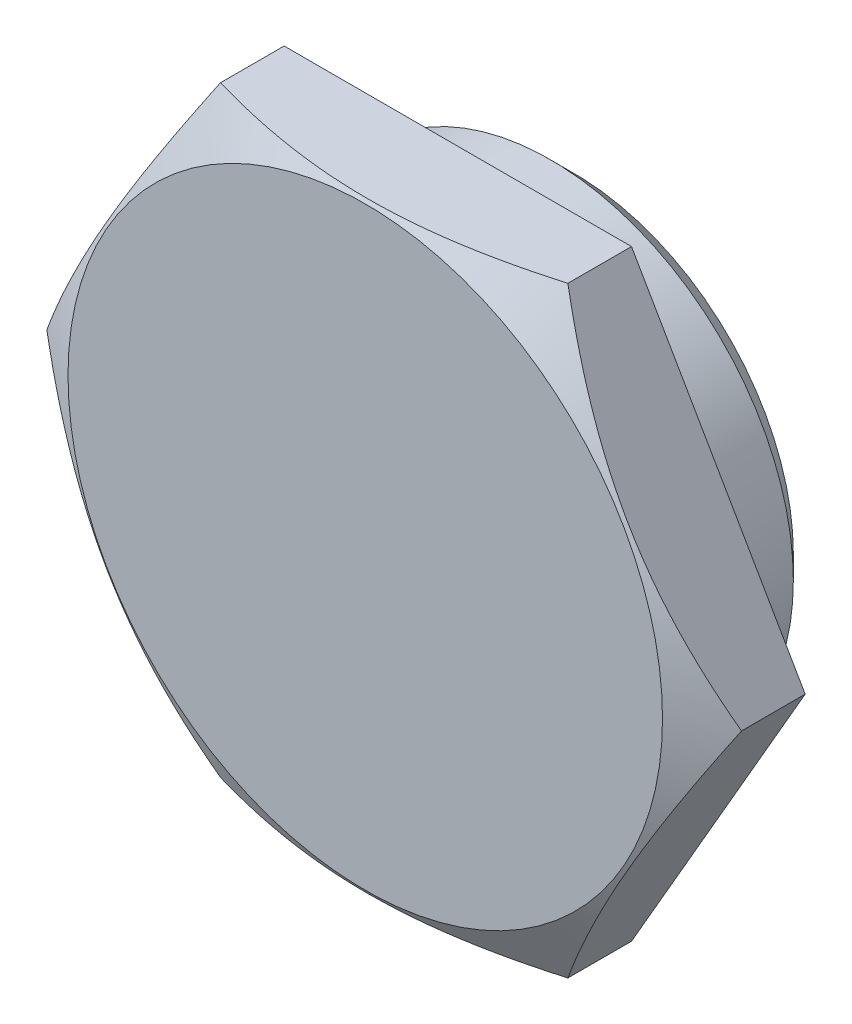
from build123d import *

# Parameters (mm, degrees)
BASE_EXTRUSION_DEPTH = 8


with BuildPart() as part:
    # Esquisse1 → Base-Extrusion (new body)
    with BuildSketch(Plane.XY):
        Polygon((-30.022213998, 0), (-15.011106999, -26), (15.011106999, -26), (30.022213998, 0), (15.011106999, 26), (-15.011106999, 26), align=None)
    extrude(amount=BASE_EXTRUSION_DEPTH)

    # Esquisse3 → Enl_vement de mati_re-R_volution1 (revolve, cut)
    with BuildSketch(Plane(origin=(0, 0, 0), x_dir=(1, 0, 0), z_dir=(0, 1, 0)), mode=Mode.PRIVATE) as enl_vement_de_mati_re_r_volution1_sk:
        Polygon((-30.022213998, -5.5), (-25.692086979, -8), (-30.022213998, -8), align=None)
    revolve(enl_vement_de_mati_re_r_volution1_sk.sketch.rotate(Axis((0, 0, 0), (0, 0, 1)), 180), axis=Axis((0, 0, 0), (0, 0, 1)), mode=Mode.SUBTRACT)

    # Esquisse4 → Boss.-R_vol.1 (revolve)
    with BuildSketch(Plane(origin=(0, 0, 0), x_dir=(0, 0, -1), z_dir=(1, 0, 0)), mode=Mode.PRIVATE) as boss_r_vol_1_sk:
        Polygon((0, 19), (2, 19), (2, 21), (8, 21), (10, 19), (10, 12), (2, 12), (2, 0), (0, 0), align=None)
    revolve(boss_r_vol_1_sk.sketch.rotate(Axis((0, 0, 0), (0, 0, -1)), 90), axis=Axis((0, 0, 0), (0, 0, -1)))


solid = part.part
